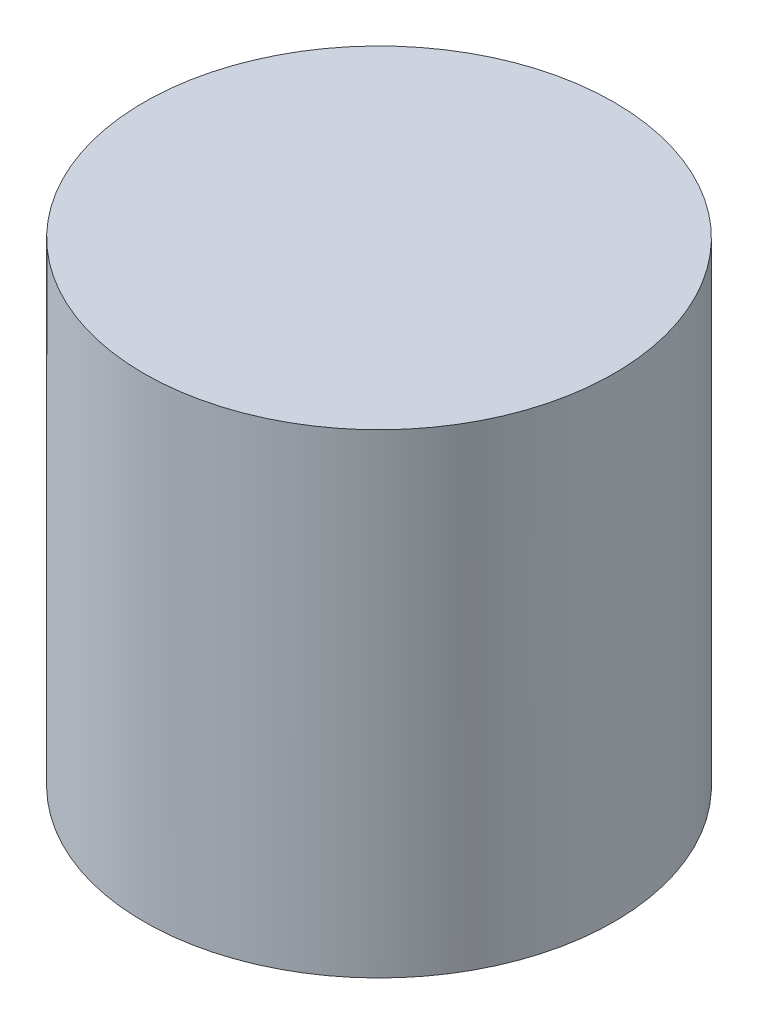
ISO-10303-21;
HEADER;
FILE_DESCRIPTION(('STEP AP214'),'2;1');
FILE_NAME('part.step','',(''),(''),'','','');
FILE_SCHEMA(('AUTOMOTIVE_DESIGN { 1 0 10303 214 1 1 1 1 }'));
ENDSEC;
DATA;
#1=APPLICATION_CONTEXT('core data for automotive mechanical design processes');
#2=APPLICATION_PROTOCOL_DEFINITION('international standard','automotive_design',2000,#1);
#3=PRODUCT_CONTEXT('',#1,'mechanical');
#4=PRODUCT('Part','Part','',(#3));
#5=PRODUCT_RELATED_PRODUCT_CATEGORY('part','',(#4));
#6=PRODUCT_DEFINITION_FORMATION('','',#4);
#7=PRODUCT_DEFINITION_CONTEXT('part definition',#1,'design');
#8=PRODUCT_DEFINITION('design','',#6,#7);
#9=PRODUCT_DEFINITION_SHAPE('','',#8);
#10=(LENGTH_UNIT() NAMED_UNIT(*) SI_UNIT(.MILLI.,.METRE.));
#11=(NAMED_UNIT(*) PLANE_ANGLE_UNIT() SI_UNIT($,.RADIAN.));
#12=(NAMED_UNIT(*) SI_UNIT($,.STERADIAN.) SOLID_ANGLE_UNIT());
#13=UNCERTAINTY_MEASURE_WITH_UNIT(LENGTH_MEASURE(1.E-05),#10,'distance_accuracy_value','');
#14=(GEOMETRIC_REPRESENTATION_CONTEXT(3) GLOBAL_UNCERTAINTY_ASSIGNED_CONTEXT((#13)) GLOBAL_UNIT_ASSIGNED_CONTEXT((#10,
#11,#12)) REPRESENTATION_CONTEXT('',''));
#15=CARTESIAN_POINT('',(0.,0.,0.));
#16=DIRECTION('',(0.,0.,1.));
#17=DIRECTION('',(1.,0.,0.));
#18=AXIS2_PLACEMENT_3D('',#15,#16,#17);
#19=CARTESIAN_POINT('',(0.,405.,-105.));
#20=DIRECTION('',(0.,-1.,0.));
#21=DIRECTION('',(0.,0.,-1.));
#22=AXIS2_PLACEMENT_3D('',#19,#20,#21);
#23=CYLINDRICAL_SURFACE('',#22,100.);
#24=CARTESIAN_POINT('',(0.,53.,-105.));
#25=DIRECTION('',(0.,-1.,0.));
#26=DIRECTION('',(0.,0.,-1.));
#27=AXIS2_PLACEMENT_3D('',#24,#25,#26);
#28=CIRCLE('',#27,100.);
#29=CARTESIAN_POINT('',(0.,53.,-205.));
#30=VERTEX_POINT('',#29);
#31=EDGE_CURVE('E77',#30,#30,#28,.T.);
#32=ORIENTED_EDGE('',*,*,#31,.F.);
#33=EDGE_LOOP('',(#32));
#34=FACE_BOUND('',#33,.T.);
#35=CARTESIAN_POINT('',(0.,255.,-105.));
#36=DIRECTION('',(0.,1.,0.));
#37=DIRECTION('',(0.,0.,1.));
#38=AXIS2_PLACEMENT_3D('',#35,#36,#37);
#39=CIRCLE('',#38,100.);
#40=CARTESIAN_POINT('',(0.,255.,-4.99999999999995));
#41=VERTEX_POINT('',#40);
#42=EDGE_CURVE('E92',#41,#41,#39,.T.);
#43=ORIENTED_EDGE('',*,*,#42,.F.);
#44=EDGE_LOOP('',(#43));
#45=FACE_BOUND('',#44,.T.);
#46=ADVANCED_FACE('F68',(#34,#45),#23,.T.);
#47=CARTESIAN_POINT('',(0.,53.,-105.));
#48=DIRECTION('',(0.,-1.,0.));
#49=DIRECTION('',(0.,0.,-1.));
#50=AXIS2_PLACEMENT_3D('',#47,#48,#49);
#51=PLANE('',#50);
#52=CARTESIAN_POINT('',(0.,53.,-105.));
#53=DIRECTION('',(0.,-1.,0.));
#54=DIRECTION('',(0.,0.,-1.));
#55=AXIS2_PLACEMENT_3D('',#52,#53,#54);
#56=CIRCLE('',#55,25.);
#57=CARTESIAN_POINT('',(0.,53.,-130.));
#58=VERTEX_POINT('',#57);
#59=EDGE_CURVE('E85',#58,#58,#56,.T.);
#60=ORIENTED_EDGE('',*,*,#59,.F.);
#61=EDGE_LOOP('',(#60));
#62=FACE_BOUND('',#61,.T.);
#63=ORIENTED_EDGE('',*,*,#31,.T.);
#64=EDGE_LOOP('',(#63));
#65=FACE_BOUND('',#64,.T.);
#66=ADVANCED_FACE('F128',(#62,#65),#51,.T.);
#67=CARTESIAN_POINT('',(0.,103.,-105.));
#68=DIRECTION('',(0.,-1.,0.));
#69=DIRECTION('',(0.,0.,-1.));
#70=AXIS2_PLACEMENT_3D('',#67,#68,#69);
#71=CYLINDRICAL_SURFACE('',#70,25.);
#72=CARTESIAN_POINT('',(0.,103.,-105.));
#73=DIRECTION('',(0.,-1.,0.));
#74=DIRECTION('',(0.,0.,-1.));
#75=AXIS2_PLACEMENT_3D('',#72,#73,#74);
#76=CIRCLE('',#75,25.);
#77=CARTESIAN_POINT('',(0.,103.,-130.));
#78=VERTEX_POINT('',#77);
#79=EDGE_CURVE('E82',#78,#78,#76,.T.);
#80=ORIENTED_EDGE('',*,*,#79,.F.);
#81=EDGE_LOOP('',(#80));
#82=FACE_BOUND('',#81,.T.);
#83=ORIENTED_EDGE('',*,*,#59,.T.);
#84=EDGE_LOOP('',(#83));
#85=FACE_BOUND('',#84,.T.);
#86=ADVANCED_FACE('F124',(#82,#85),#71,.F.);
#87=CARTESIAN_POINT('',(0.,103.,-105.));
#88=DIRECTION('',(0.,-1.,0.));
#89=DIRECTION('',(0.,0.,-1.));
#90=AXIS2_PLACEMENT_3D('',#87,#88,#89);
#91=PLANE('',#90);
#92=ORIENTED_EDGE('',*,*,#79,.T.);
#93=EDGE_LOOP('',(#92));
#94=FACE_BOUND('',#93,.T.);
#95=ADVANCED_FACE('F122',(#94),#91,.T.);
#96=CARTESIAN_POINT('',(0.,255.,-105.));
#97=DIRECTION('',(0.,1.,0.));
#98=DIRECTION('',(0.,0.,1.));
#99=AXIS2_PLACEMENT_3D('',#96,#97,#98);
#100=PLANE('',#99);
#101=ORIENTED_EDGE('',*,*,#42,.T.);
#102=EDGE_LOOP('',(#101));
#103=FACE_BOUND('',#102,.T.);
#104=ADVANCED_FACE('F121',(#103),#100,.T.);
#105=CLOSED_SHELL('',(#46,#66,#86,#95,#104));
#106=CARTESIAN_POINT('',(0.,253.,-105.));
#107=DIRECTION('',(0.,1.,0.));
#108=DIRECTION('',(0.,0.,1.));
#109=AXIS2_PLACEMENT_3D('',#106,#107,#108);
#110=PLANE('',#109);
#111=CARTESIAN_POINT('',(0.,253.,-105.));
#112=DIRECTION('',(0.,-1.,0.));
#113=DIRECTION('',(0.,0.,-1.));
#114=AXIS2_PLACEMENT_3D('',#111,#112,#113);
#115=CIRCLE('',#114,98.);
#116=CARTESIAN_POINT('',(0.,253.,-203.));
#117=VERTEX_POINT('',#116);
#118=EDGE_CURVE('E71',#117,#117,#115,.T.);
#119=ORIENTED_EDGE('',*,*,#118,.T.);
#120=EDGE_LOOP('',(#119));
#121=FACE_BOUND('',#120,.T.);
#122=ADVANCED_FACE('F101',(#121),#110,.F.);
#123=CARTESIAN_POINT('',(0.,105.,-105.));
#124=DIRECTION('',(0.,-1.,0.));
#125=DIRECTION('',(0.,0.,-1.));
#126=AXIS2_PLACEMENT_3D('',#123,#124,#125);
#127=PLANE('',#126);
#128=CARTESIAN_POINT('',(0.,105.,-105.));
#129=DIRECTION('',(0.,1.,0.));
#130=DIRECTION('',(0.,0.,1.));
#131=AXIS2_PLACEMENT_3D('',#128,#129,#130);
#132=CIRCLE('',#131,98.);
#133=CARTESIAN_POINT('',(0.,105.,-6.99999999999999));
#134=VERTEX_POINT('',#133);
#135=EDGE_CURVE('E11',#134,#134,#132,.F.);
#136=ORIENTED_EDGE('',*,*,#135,.F.);
#137=EDGE_LOOP('',(#136));
#138=FACE_BOUND('',#137,.T.);
#139=ADVANCED_FACE('F105',(#138),#127,.F.);
#140=CARTESIAN_POINT('',(0.,405.,-105.));
#141=DIRECTION('',(0.,-1.,0.));
#142=DIRECTION('',(0.,0.,-1.));
#143=AXIS2_PLACEMENT_3D('',#140,#141,#142);
#144=CYLINDRICAL_SURFACE('',#143,98.);
#145=ORIENTED_EDGE('',*,*,#118,.F.);
#146=EDGE_LOOP('',(#145));
#147=FACE_BOUND('',#146,.T.);
#148=ORIENTED_EDGE('',*,*,#135,.T.);
#149=EDGE_LOOP('',(#148));
#150=FACE_BOUND('',#149,.T.);
#151=ADVANCED_FACE('F103',(#147,#150),#144,.F.);
#152=CLOSED_SHELL('',(#122,#139,#151));
#153=ORIENTED_CLOSED_SHELL('',*,#152,.T.);
#154=BREP_WITH_VOIDS('B2',#105,(#153));
#155=ADVANCED_BREP_SHAPE_REPRESENTATION('',(#18,#154),#14);
#156=SHAPE_DEFINITION_REPRESENTATION(#9,#155);
ENDSEC;
END-ISO-10303-21;
